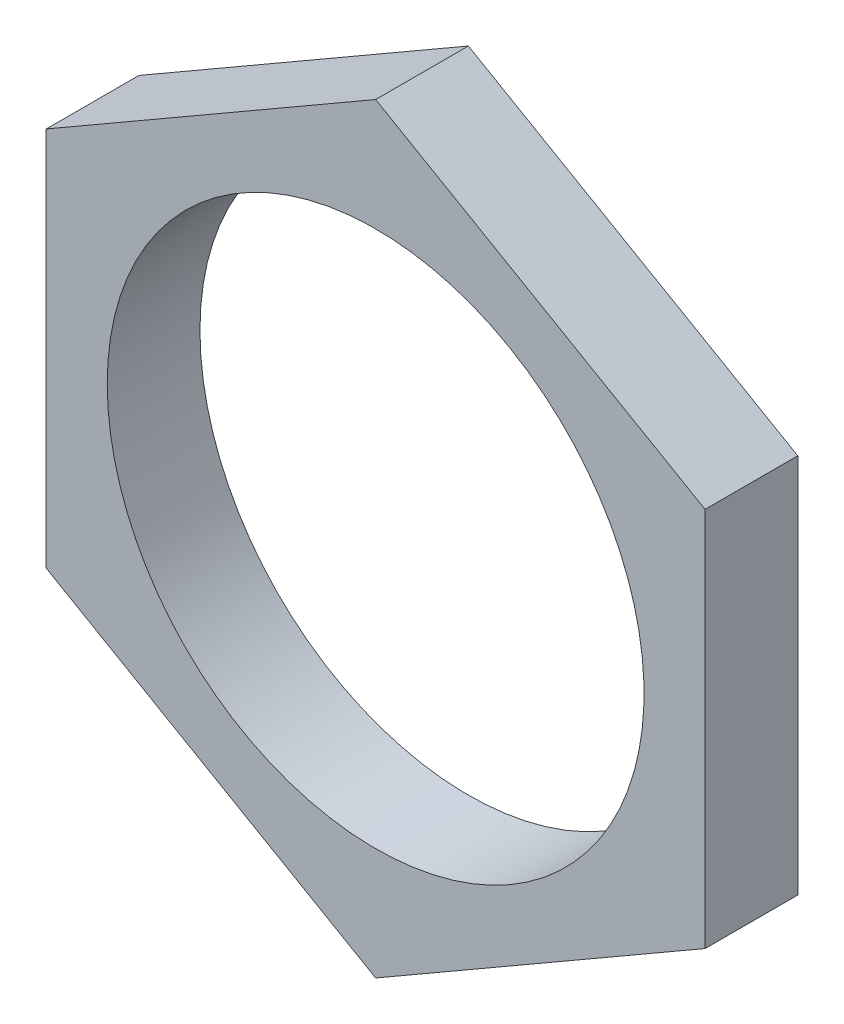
ISO-10303-21;
HEADER;
FILE_DESCRIPTION(('STEP AP214'),'2;1');
FILE_NAME('part.step','',(''),(''),'','','');
FILE_SCHEMA(('AUTOMOTIVE_DESIGN { 1 0 10303 214 1 1 1 1 }'));
ENDSEC;
DATA;
#1=APPLICATION_CONTEXT('core data for automotive mechanical design processes');
#2=APPLICATION_PROTOCOL_DEFINITION('international standard','automotive_design',2000,#1);
#3=PRODUCT_CONTEXT('',#1,'mechanical');
#4=PRODUCT('Part','Part','',(#3));
#5=PRODUCT_RELATED_PRODUCT_CATEGORY('part','',(#4));
#6=PRODUCT_DEFINITION_FORMATION('','',#4);
#7=PRODUCT_DEFINITION_CONTEXT('part definition',#1,'design');
#8=PRODUCT_DEFINITION('design','',#6,#7);
#9=PRODUCT_DEFINITION_SHAPE('','',#8);
#10=(LENGTH_UNIT() NAMED_UNIT(*) SI_UNIT(.MILLI.,.METRE.));
#11=(NAMED_UNIT(*) PLANE_ANGLE_UNIT() SI_UNIT($,.RADIAN.));
#12=(NAMED_UNIT(*) SI_UNIT($,.STERADIAN.) SOLID_ANGLE_UNIT());
#13=UNCERTAINTY_MEASURE_WITH_UNIT(LENGTH_MEASURE(1.E-05),#10,'distance_accuracy_value','');
#14=(GEOMETRIC_REPRESENTATION_CONTEXT(3) GLOBAL_UNCERTAINTY_ASSIGNED_CONTEXT((#13)) GLOBAL_UNIT_ASSIGNED_CONTEXT((#10,
#11,#12)) REPRESENTATION_CONTEXT('',''));
#15=CARTESIAN_POINT('',(0.,0.,0.));
#16=DIRECTION('',(0.,0.,1.));
#17=DIRECTION('',(1.,0.,0.));
#18=AXIS2_PLACEMENT_3D('',#15,#16,#17);
#19=CARTESIAN_POINT('',(0.,0.,3.8));
#20=DIRECTION('',(0.,0.,-1.));
#21=DIRECTION('',(0.500000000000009,0.866025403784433,0.));
#22=AXIS2_PLACEMENT_3D('',#19,#20,#21);
#23=PLANE('',#22);
#24=CARTESIAN_POINT('',(0.,0.,3.8));
#25=DIRECTION('',(0.,0.,-1.));
#26=DIRECTION('',(0.500000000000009,0.866025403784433,0.));
#27=AXIS2_PLACEMENT_3D('',#24,#25,#26);
#28=CIRCLE('',#27,11.);
#29=CARTESIAN_POINT('',(5.5000000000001,9.52627944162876,3.8));
#30=VERTEX_POINT('',#29);
#31=EDGE_CURVE('E80',#30,#30,#28,.T.);
#32=ORIENTED_EDGE('',*,*,#31,.T.);
#33=EDGE_LOOP('',(#32));
#34=FACE_BOUND('',#33,.T.);
#35=DIRECTION('',(0.866025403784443,0.499999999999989,0.));
#36=VECTOR('',#35,1.);
#37=CARTESIAN_POINT('',(-13.5,7.79422863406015,3.8));
#38=LINE('',#37,#36);
#39=CARTESIAN_POINT('',(-13.5,7.7942286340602,3.8));
#40=VERTEX_POINT('',#39);
#41=CARTESIAN_POINT('',(1.23165366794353E-13,15.5884572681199,3.8));
#42=VERTEX_POINT('',#41);
#43=EDGE_CURVE('E69',#40,#42,#38,.T.);
#44=ORIENTED_EDGE('',*,*,#43,.F.);
#45=DIRECTION('',(0.,1.,0.));
#46=VECTOR('',#45,1.);
#47=CARTESIAN_POINT('',(-13.5000000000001,-7.79422863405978,3.8));
#48=LINE('',#47,#46);
#49=CARTESIAN_POINT('',(-13.5,-7.7942286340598,3.8));
#50=VERTEX_POINT('',#49);
#51=EDGE_CURVE('E119',#50,#40,#48,.T.);
#52=ORIENTED_EDGE('',*,*,#51,.F.);
#53=DIRECTION('',(0.866025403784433,-0.500000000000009,0.));
#54=VECTOR('',#53,1.);
#55=CARTESIAN_POINT('',(-6.75000000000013,-11.6913429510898,3.8));
#56=LINE('',#55,#54);
#57=CARTESIAN_POINT('',(-1.23165366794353E-13,-15.5884572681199,3.8));
#58=VERTEX_POINT('',#57);
#59=EDGE_CURVE('E106',#58,#50,#56,.F.);
#60=ORIENTED_EDGE('',*,*,#59,.F.);
#61=DIRECTION('',(-0.866025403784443,-0.499999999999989,0.));
#62=VECTOR('',#61,1.);
#63=CARTESIAN_POINT('',(13.5,-7.79422863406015,3.8));
#64=LINE('',#63,#62);
#65=CARTESIAN_POINT('',(13.5,-7.7942286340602,3.8));
#66=VERTEX_POINT('',#65);
#67=EDGE_CURVE('E102',#66,#58,#64,.T.);
#68=ORIENTED_EDGE('',*,*,#67,.F.);
#69=DIRECTION('',(0.,-1.,0.));
#70=VECTOR('',#69,1.);
#71=CARTESIAN_POINT('',(13.5000000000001,7.79422863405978,3.8));
#72=LINE('',#71,#70);
#73=CARTESIAN_POINT('',(13.5,7.79422863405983,3.8));
#74=VERTEX_POINT('',#73);
#75=EDGE_CURVE('E84',#74,#66,#72,.T.);
#76=ORIENTED_EDGE('',*,*,#75,.F.);
#77=DIRECTION('',(0.866025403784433,-0.500000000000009,0.));
#78=VECTOR('',#77,1.);
#79=CARTESIAN_POINT('',(6.75000000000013,11.6913429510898,3.8));
#80=LINE('',#79,#78);
#81=EDGE_CURVE('E79',#42,#74,#80,.T.);
#82=ORIENTED_EDGE('',*,*,#81,.F.);
#83=EDGE_LOOP('',(#44,#52,#60,#68,#76,#82));
#84=FACE_BOUND('',#83,.T.);
#85=ADVANCED_FACE('F14',(#34,#84),#23,.F.);
#86=CARTESIAN_POINT('',(0.,0.,0.));
#87=DIRECTION('',(0.,0.,-1.));
#88=DIRECTION('',(0.500000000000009,0.866025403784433,0.));
#89=AXIS2_PLACEMENT_3D('',#86,#87,#88);
#90=PLANE('',#89);
#91=CARTESIAN_POINT('',(0.,0.,0.));
#92=DIRECTION('',(0.,0.,-1.));
#93=DIRECTION('',(0.500000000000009,0.866025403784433,0.));
#94=AXIS2_PLACEMENT_3D('',#91,#92,#93);
#95=CIRCLE('',#94,11.);
#96=CARTESIAN_POINT('',(5.5000000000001,9.52627944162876,0.));
#97=VERTEX_POINT('',#96);
#98=EDGE_CURVE('E124',#97,#97,#95,.T.);
#99=ORIENTED_EDGE('',*,*,#98,.F.);
#100=EDGE_LOOP('',(#99));
#101=FACE_BOUND('',#100,.T.);
#102=DIRECTION('',(0.866025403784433,-0.500000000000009,0.));
#103=VECTOR('',#102,1.);
#104=CARTESIAN_POINT('',(13.5000000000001,7.79422863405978,0.));
#105=LINE('',#104,#103);
#106=CARTESIAN_POINT('',(1.23165366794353E-13,15.5884572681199,0.));
#107=VERTEX_POINT('',#106);
#108=CARTESIAN_POINT('',(13.5,7.7942286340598,0.));
#109=VERTEX_POINT('',#108);
#110=EDGE_CURVE('E29',#107,#109,#105,.T.);
#111=ORIENTED_EDGE('',*,*,#110,.T.);
#112=DIRECTION('',(0.,-1.,0.));
#113=VECTOR('',#112,1.);
#114=CARTESIAN_POINT('',(13.5,-7.79422863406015,0.));
#115=LINE('',#114,#113);
#116=CARTESIAN_POINT('',(13.5,-7.7942286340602,0.));
#117=VERTEX_POINT('',#116);
#118=EDGE_CURVE('E91',#109,#117,#115,.T.);
#119=ORIENTED_EDGE('',*,*,#118,.T.);
#120=DIRECTION('',(-0.866025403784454,-0.499999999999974,0.));
#121=VECTOR('',#120,1.);
#122=CARTESIAN_POINT('',(-1.23165366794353E-13,-15.5884572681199,0.));
#123=LINE('',#122,#121);
#124=CARTESIAN_POINT('',(-1.23165366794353E-13,-15.5884572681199,0.));
#125=VERTEX_POINT('',#124);
#126=EDGE_CURVE('E37',#117,#125,#123,.T.);
#127=ORIENTED_EDGE('',*,*,#126,.T.);
#128=DIRECTION('',(-0.866025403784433,0.500000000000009,0.));
#129=VECTOR('',#128,1.);
#130=CARTESIAN_POINT('',(-13.5000000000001,-7.79422863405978,0.));
#131=LINE('',#130,#129);
#132=CARTESIAN_POINT('',(-13.5,-7.7942286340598,0.));
#133=VERTEX_POINT('',#132);
#134=EDGE_CURVE('E108',#125,#133,#131,.T.);
#135=ORIENTED_EDGE('',*,*,#134,.T.);
#136=DIRECTION('',(0.,1.,0.));
#137=VECTOR('',#136,1.);
#138=CARTESIAN_POINT('',(-13.5,7.79422863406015,0.));
#139=LINE('',#138,#137);
#140=CARTESIAN_POINT('',(-13.5,7.7942286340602,0.));
#141=VERTEX_POINT('',#140);
#142=EDGE_CURVE('E111',#133,#141,#139,.T.);
#143=ORIENTED_EDGE('',*,*,#142,.T.);
#144=DIRECTION('',(0.866025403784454,0.499999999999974,0.));
#145=VECTOR('',#144,1.);
#146=CARTESIAN_POINT('',(1.23165366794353E-13,15.5884572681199,0.));
#147=LINE('',#146,#145);
#148=EDGE_CURVE('E116',#141,#107,#147,.T.);
#149=ORIENTED_EDGE('',*,*,#148,.T.);
#150=EDGE_LOOP('',(#111,#119,#127,#135,#143,#149));
#151=FACE_BOUND('',#150,.T.);
#152=ADVANCED_FACE('F113',(#101,#151),#90,.T.);
#153=CARTESIAN_POINT('',(13.5000000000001,7.79422863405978,0.));
#154=DIRECTION('',(-0.500000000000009,-0.866025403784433,0.));
#155=DIRECTION('',(0.866025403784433,-0.500000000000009,0.));
#156=AXIS2_PLACEMENT_3D('',#153,#154,#155);
#157=PLANE('',#156);
#158=ORIENTED_EDGE('',*,*,#81,.T.);
#159=DIRECTION('',(0.,0.,1.));
#160=VECTOR('',#159,1.);
#161=CARTESIAN_POINT('',(13.5000000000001,7.79422863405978,0.));
#162=LINE('',#161,#160);
#163=EDGE_CURVE('E90',#109,#74,#162,.T.);
#164=ORIENTED_EDGE('',*,*,#163,.F.);
#165=ORIENTED_EDGE('',*,*,#110,.F.);
#166=DIRECTION('',(0.,0.,1.));
#167=VECTOR('',#166,1.);
#168=CARTESIAN_POINT('',(1.23165366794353E-13,15.5884572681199,0.));
#169=LINE('',#168,#167);
#170=EDGE_CURVE('E73',#42,#107,#169,.F.);
#171=ORIENTED_EDGE('',*,*,#170,.F.);
#172=EDGE_LOOP('',(#158,#164,#165,#171));
#173=FACE_BOUND('',#172,.T.);
#174=ADVANCED_FACE('F89',(#173),#157,.F.);
#175=CARTESIAN_POINT('',(1.23165366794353E-13,15.5884572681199,0.));
#176=DIRECTION('',(0.499999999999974,-0.866025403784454,0.));
#177=DIRECTION('',(0.866025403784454,0.499999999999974,0.));
#178=AXIS2_PLACEMENT_3D('',#175,#176,#177);
#179=PLANE('',#178);
#180=ORIENTED_EDGE('',*,*,#43,.T.);
#181=ORIENTED_EDGE('',*,*,#170,.T.);
#182=ORIENTED_EDGE('',*,*,#148,.F.);
#183=DIRECTION('',(0.,0.,1.));
#184=VECTOR('',#183,1.);
#185=CARTESIAN_POINT('',(-13.5000000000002,7.79422863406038,0.));
#186=LINE('',#185,#184);
#187=EDGE_CURVE('E75',#40,#141,#186,.F.);
#188=ORIENTED_EDGE('',*,*,#187,.F.);
#189=EDGE_LOOP('',(#180,#181,#182,#188));
#190=FACE_BOUND('',#189,.T.);
#191=ADVANCED_FACE('F71',(#190),#179,.F.);
#192=CARTESIAN_POINT('',(-13.5,7.79422863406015,0.));
#193=DIRECTION('',(1.,0.,0.));
#194=DIRECTION('',(0.,1.,0.));
#195=AXIS2_PLACEMENT_3D('',#192,#193,#194);
#196=PLANE('',#195);
#197=ORIENTED_EDGE('',*,*,#51,.T.);
#198=ORIENTED_EDGE('',*,*,#187,.T.);
#199=ORIENTED_EDGE('',*,*,#142,.F.);
#200=DIRECTION('',(0.,0.,1.));
#201=VECTOR('',#200,1.);
#202=CARTESIAN_POINT('',(-13.4999999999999,-7.79422863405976,0.));
#203=LINE('',#202,#201);
#204=EDGE_CURVE('E98',#50,#133,#203,.F.);
#205=ORIENTED_EDGE('',*,*,#204,.F.);
#206=EDGE_LOOP('',(#197,#198,#199,#205));
#207=FACE_BOUND('',#206,.T.);
#208=ADVANCED_FACE('F154',(#207),#196,.F.);
#209=CARTESIAN_POINT('',(-13.5000000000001,-7.79422863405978,0.));
#210=DIRECTION('',(0.500000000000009,0.866025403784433,0.));
#211=DIRECTION('',(-0.866025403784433,0.500000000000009,0.));
#212=AXIS2_PLACEMENT_3D('',#209,#210,#211);
#213=PLANE('',#212);
#214=ORIENTED_EDGE('',*,*,#59,.T.);
#215=ORIENTED_EDGE('',*,*,#204,.T.);
#216=ORIENTED_EDGE('',*,*,#134,.F.);
#217=DIRECTION('',(0.,0.,1.));
#218=VECTOR('',#217,1.);
#219=CARTESIAN_POINT('',(-1.23165366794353E-13,-15.5884572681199,0.));
#220=LINE('',#219,#218);
#221=EDGE_CURVE('E22',#58,#125,#220,.F.);
#222=ORIENTED_EDGE('',*,*,#221,.F.);
#223=EDGE_LOOP('',(#214,#215,#216,#222));
#224=FACE_BOUND('',#223,.T.);
#225=ADVANCED_FACE('F105',(#224),#213,.F.);
#226=CARTESIAN_POINT('',(-1.23165366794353E-13,-15.5884572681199,0.));
#227=DIRECTION('',(-0.499999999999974,0.866025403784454,0.));
#228=DIRECTION('',(-0.866025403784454,-0.499999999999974,0.));
#229=AXIS2_PLACEMENT_3D('',#226,#227,#228);
#230=PLANE('',#229);
#231=ORIENTED_EDGE('',*,*,#67,.T.);
#232=ORIENTED_EDGE('',*,*,#221,.T.);
#233=ORIENTED_EDGE('',*,*,#126,.F.);
#234=DIRECTION('',(0.,0.,1.));
#235=VECTOR('',#234,1.);
#236=CARTESIAN_POINT('',(13.5000000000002,-7.79422863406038,0.));
#237=LINE('',#236,#235);
#238=EDGE_CURVE('E9',#66,#117,#237,.F.);
#239=ORIENTED_EDGE('',*,*,#238,.F.);
#240=EDGE_LOOP('',(#231,#232,#233,#239));
#241=FACE_BOUND('',#240,.T.);
#242=ADVANCED_FACE('F101',(#241),#230,.F.);
#243=CARTESIAN_POINT('',(13.5,-7.79422863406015,0.));
#244=DIRECTION('',(-1.,0.,0.));
#245=DIRECTION('',(0.,-1.,0.));
#246=AXIS2_PLACEMENT_3D('',#243,#244,#245);
#247=PLANE('',#246);
#248=ORIENTED_EDGE('',*,*,#75,.T.);
#249=ORIENTED_EDGE('',*,*,#238,.T.);
#250=ORIENTED_EDGE('',*,*,#118,.F.);
#251=ORIENTED_EDGE('',*,*,#163,.T.);
#252=EDGE_LOOP('',(#248,#249,#250,#251));
#253=FACE_BOUND('',#252,.T.);
#254=ADVANCED_FACE('F16',(#253),#247,.F.);
#255=CARTESIAN_POINT('',(0.,0.,3.8));
#256=DIRECTION('',(0.,0.,-1.));
#257=DIRECTION('',(0.500000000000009,0.866025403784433,0.));
#258=AXIS2_PLACEMENT_3D('',#255,#256,#257);
#259=CYLINDRICAL_SURFACE('',#258,11.);
#260=ORIENTED_EDGE('',*,*,#31,.F.);
#261=EDGE_LOOP('',(#260));
#262=FACE_BOUND('',#261,.T.);
#263=ORIENTED_EDGE('',*,*,#98,.T.);
#264=EDGE_LOOP('',(#263));
#265=FACE_BOUND('',#264,.T.);
#266=ADVANCED_FACE('F131',(#262,#265),#259,.F.);
#267=CLOSED_SHELL('',(#85,#152,#174,#191,#208,#225,#242,#254,#266));
#268=MANIFOLD_SOLID_BREP('B1',#267);
#269=ADVANCED_BREP_SHAPE_REPRESENTATION('',(#18,#268),#14);
#270=SHAPE_DEFINITION_REPRESENTATION(#9,#269);
ENDSEC;
END-ISO-10303-21;
